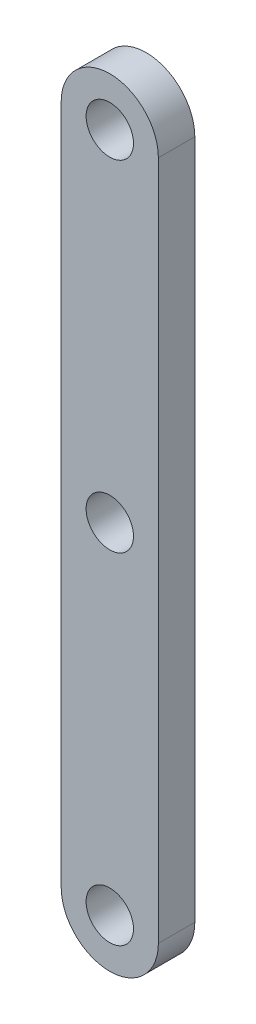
ISO-10303-21;
HEADER;
FILE_DESCRIPTION(('STEP AP214'),'2;1');
FILE_NAME('part.step','',(''),(''),'','','');
FILE_SCHEMA(('AUTOMOTIVE_DESIGN { 1 0 10303 214 1 1 1 1 }'));
ENDSEC;
DATA;
#1=APPLICATION_CONTEXT('core data for automotive mechanical design processes');
#2=APPLICATION_PROTOCOL_DEFINITION('international standard','automotive_design',2000,#1);
#3=PRODUCT_CONTEXT('',#1,'mechanical');
#4=PRODUCT('Part','Part','',(#3));
#5=PRODUCT_RELATED_PRODUCT_CATEGORY('part','',(#4));
#6=PRODUCT_DEFINITION_FORMATION('','',#4);
#7=PRODUCT_DEFINITION_CONTEXT('part definition',#1,'design');
#8=PRODUCT_DEFINITION('design','',#6,#7);
#9=PRODUCT_DEFINITION_SHAPE('','',#8);
#10=(LENGTH_UNIT() NAMED_UNIT(*) SI_UNIT(.MILLI.,.METRE.));
#11=(NAMED_UNIT(*) PLANE_ANGLE_UNIT() SI_UNIT($,.RADIAN.));
#12=(NAMED_UNIT(*) SI_UNIT($,.STERADIAN.) SOLID_ANGLE_UNIT());
#13=UNCERTAINTY_MEASURE_WITH_UNIT(LENGTH_MEASURE(1.E-05),#10,'distance_accuracy_value','');
#14=(GEOMETRIC_REPRESENTATION_CONTEXT(3) GLOBAL_UNCERTAINTY_ASSIGNED_CONTEXT((#13)) GLOBAL_UNIT_ASSIGNED_CONTEXT((#10,
#11,#12)) REPRESENTATION_CONTEXT('',''));
#15=CARTESIAN_POINT('',(0.,0.,0.));
#16=DIRECTION('',(0.,0.,1.));
#17=DIRECTION('',(1.,0.,0.));
#18=AXIS2_PLACEMENT_3D('',#15,#16,#17);
#19=CARTESIAN_POINT('',(0.,0.,3.));
#20=DIRECTION('',(0.,0.,-1.));
#21=DIRECTION('',(-1.,0.,0.));
#22=AXIS2_PLACEMENT_3D('',#19,#20,#21);
#23=CYLINDRICAL_SURFACE('',#22,4.);
#24=CARTESIAN_POINT('',(0.,0.,0.));
#25=DIRECTION('',(0.,0.,1.));
#26=DIRECTION('',(1.,0.,0.));
#27=AXIS2_PLACEMENT_3D('',#24,#25,#26);
#28=CIRCLE('',#27,4.);
#29=CARTESIAN_POINT('',(-4.,0.,0.));
#30=VERTEX_POINT('',#29);
#31=CARTESIAN_POINT('',(4.,0.,0.));
#32=VERTEX_POINT('',#31);
#33=EDGE_CURVE('E98',#30,#32,#28,.T.);
#34=ORIENTED_EDGE('',*,*,#33,.T.);
#35=DIRECTION('',(0.,0.,-1.));
#36=VECTOR('',#35,1.);
#37=CARTESIAN_POINT('',(4.,0.,3.));
#38=LINE('',#37,#36);
#39=CARTESIAN_POINT('',(4.,0.,3.));
#40=VERTEX_POINT('',#39);
#41=EDGE_CURVE('E11',#40,#32,#38,.T.);
#42=ORIENTED_EDGE('',*,*,#41,.F.);
#43=CARTESIAN_POINT('',(0.,0.,3.));
#44=DIRECTION('',(0.,0.,1.));
#45=DIRECTION('',(1.,0.,0.));
#46=AXIS2_PLACEMENT_3D('',#43,#44,#45);
#47=CIRCLE('',#46,4.);
#48=CARTESIAN_POINT('',(-4.,0.,3.));
#49=VERTEX_POINT('',#48);
#50=EDGE_CURVE('E86',#49,#40,#47,.T.);
#51=ORIENTED_EDGE('',*,*,#50,.F.);
#52=DIRECTION('',(0.,0.,-1.));
#53=VECTOR('',#52,1.);
#54=CARTESIAN_POINT('',(-4.,0.,3.));
#55=LINE('',#54,#53);
#56=EDGE_CURVE('E94',#49,#30,#55,.T.);
#57=ORIENTED_EDGE('',*,*,#56,.T.);
#58=EDGE_LOOP('',(#34,#42,#51,#57));
#59=FACE_BOUND('',#58,.T.);
#60=ADVANCED_FACE('F35',(#59),#23,.T.);
#61=CARTESIAN_POINT('',(4.,0.,3.));
#62=DIRECTION('',(-1.,0.,0.));
#63=DIRECTION('',(0.,0.,1.));
#64=AXIS2_PLACEMENT_3D('',#61,#62,#63);
#65=PLANE('',#64);
#66=DIRECTION('',(0.,1.,0.));
#67=VECTOR('',#66,1.);
#68=CARTESIAN_POINT('',(4.,0.,0.));
#69=LINE('',#68,#67);
#70=CARTESIAN_POINT('',(4.,56.,0.));
#71=VERTEX_POINT('',#70);
#72=EDGE_CURVE('E90',#32,#71,#69,.T.);
#73=ORIENTED_EDGE('',*,*,#72,.T.);
#74=DIRECTION('',(0.,0.,-1.));
#75=VECTOR('',#74,1.);
#76=CARTESIAN_POINT('',(4.,56.,3.));
#77=LINE('',#76,#75);
#78=CARTESIAN_POINT('',(4.,56.,3.));
#79=VERTEX_POINT('',#78);
#80=EDGE_CURVE('E43',#79,#71,#77,.T.);
#81=ORIENTED_EDGE('',*,*,#80,.F.);
#82=DIRECTION('',(0.,1.,0.));
#83=VECTOR('',#82,1.);
#84=CARTESIAN_POINT('',(4.,0.,3.));
#85=LINE('',#84,#83);
#86=EDGE_CURVE('E81',#40,#79,#85,.T.);
#87=ORIENTED_EDGE('',*,*,#86,.F.);
#88=ORIENTED_EDGE('',*,*,#41,.T.);
#89=EDGE_LOOP('',(#73,#81,#87,#88));
#90=FACE_BOUND('',#89,.T.);
#91=ADVANCED_FACE('F89',(#90),#65,.F.);
#92=CARTESIAN_POINT('',(0.,56.,3.));
#93=DIRECTION('',(0.,0.,-1.));
#94=DIRECTION('',(-1.,0.,0.));
#95=AXIS2_PLACEMENT_3D('',#92,#93,#94);
#96=CYLINDRICAL_SURFACE('',#95,4.);
#97=CARTESIAN_POINT('',(0.,56.,0.));
#98=DIRECTION('',(0.,0.,1.));
#99=DIRECTION('',(1.,0.,0.));
#100=AXIS2_PLACEMENT_3D('',#97,#98,#99);
#101=CIRCLE('',#100,4.);
#102=CARTESIAN_POINT('',(-4.,56.,0.));
#103=VERTEX_POINT('',#102);
#104=EDGE_CURVE('E68',#71,#103,#101,.T.);
#105=ORIENTED_EDGE('',*,*,#104,.T.);
#106=DIRECTION('',(0.,0.,-1.));
#107=VECTOR('',#106,1.);
#108=CARTESIAN_POINT('',(-4.,56.,3.));
#109=LINE('',#108,#107);
#110=CARTESIAN_POINT('',(-4.,56.,3.));
#111=VERTEX_POINT('',#110);
#112=EDGE_CURVE('E91',#111,#103,#109,.T.);
#113=ORIENTED_EDGE('',*,*,#112,.F.);
#114=CARTESIAN_POINT('',(0.,56.,3.));
#115=DIRECTION('',(0.,0.,1.));
#116=DIRECTION('',(1.,0.,0.));
#117=AXIS2_PLACEMENT_3D('',#114,#115,#116);
#118=CIRCLE('',#117,4.);
#119=EDGE_CURVE('E84',#79,#111,#118,.T.);
#120=ORIENTED_EDGE('',*,*,#119,.F.);
#121=ORIENTED_EDGE('',*,*,#80,.T.);
#122=EDGE_LOOP('',(#105,#113,#120,#121));
#123=FACE_BOUND('',#122,.T.);
#124=ADVANCED_FACE('F92',(#123),#96,.T.);
#125=CARTESIAN_POINT('',(-4.,0.,3.));
#126=DIRECTION('',(1.,0.,0.));
#127=DIRECTION('',(0.,0.,-1.));
#128=AXIS2_PLACEMENT_3D('',#125,#126,#127);
#129=PLANE('',#128);
#130=DIRECTION('',(0.,-1.,0.));
#131=VECTOR('',#130,1.);
#132=CARTESIAN_POINT('',(-4.,0.,0.));
#133=LINE('',#132,#131);
#134=EDGE_CURVE('E74',#103,#30,#133,.T.);
#135=ORIENTED_EDGE('',*,*,#134,.T.);
#136=ORIENTED_EDGE('',*,*,#56,.F.);
#137=DIRECTION('',(0.,-1.,0.));
#138=VECTOR('',#137,1.);
#139=CARTESIAN_POINT('',(-4.,0.,3.));
#140=LINE('',#139,#138);
#141=EDGE_CURVE('E51',#111,#49,#140,.T.);
#142=ORIENTED_EDGE('',*,*,#141,.F.);
#143=ORIENTED_EDGE('',*,*,#112,.T.);
#144=EDGE_LOOP('',(#135,#136,#142,#143));
#145=FACE_BOUND('',#144,.T.);
#146=ADVANCED_FACE('F106',(#145),#129,.F.);
#147=CARTESIAN_POINT('',(0.,0.,3.));
#148=DIRECTION('',(0.,0.,1.));
#149=DIRECTION('',(1.,0.,0.));
#150=AXIS2_PLACEMENT_3D('',#147,#148,#149);
#151=PLANE('',#150);
#152=CARTESIAN_POINT('',(0.,28.,3.));
#153=DIRECTION('',(0.,0.,1.));
#154=DIRECTION('',(1.,0.,0.));
#155=AXIS2_PLACEMENT_3D('',#152,#153,#154);
#156=CIRCLE('',#155,1.95);
#157=CARTESIAN_POINT('',(1.95,28.,3.));
#158=VERTEX_POINT('',#157);
#159=EDGE_CURVE('E126',#158,#158,#156,.T.);
#160=ORIENTED_EDGE('',*,*,#159,.F.);
#161=EDGE_LOOP('',(#160));
#162=FACE_BOUND('',#161,.T.);
#163=CARTESIAN_POINT('',(0.,56.,3.));
#164=DIRECTION('',(0.,0.,1.));
#165=DIRECTION('',(1.,0.,0.));
#166=AXIS2_PLACEMENT_3D('',#163,#164,#165);
#167=CIRCLE('',#166,1.95);
#168=CARTESIAN_POINT('',(1.95,56.,3.));
#169=VERTEX_POINT('',#168);
#170=EDGE_CURVE('E120',#169,#169,#167,.T.);
#171=ORIENTED_EDGE('',*,*,#170,.F.);
#172=EDGE_LOOP('',(#171));
#173=FACE_BOUND('',#172,.T.);
#174=CARTESIAN_POINT('',(0.,0.,3.));
#175=DIRECTION('',(0.,0.,1.));
#176=DIRECTION('',(1.,0.,0.));
#177=AXIS2_PLACEMENT_3D('',#174,#175,#176);
#178=CIRCLE('',#177,1.95);
#179=CARTESIAN_POINT('',(1.95,0.,3.));
#180=VERTEX_POINT('',#179);
#181=EDGE_CURVE('E114',#180,#180,#178,.T.);
#182=ORIENTED_EDGE('',*,*,#181,.F.);
#183=EDGE_LOOP('',(#182));
#184=FACE_BOUND('',#183,.T.);
#185=ORIENTED_EDGE('',*,*,#50,.T.);
#186=ORIENTED_EDGE('',*,*,#86,.T.);
#187=ORIENTED_EDGE('',*,*,#119,.T.);
#188=ORIENTED_EDGE('',*,*,#141,.T.);
#189=EDGE_LOOP('',(#185,#186,#187,#188));
#190=FACE_BOUND('',#189,.T.);
#191=ADVANCED_FACE('F82',(#162,#173,#184,#190),#151,.T.);
#192=CARTESIAN_POINT('',(0.,0.,0.));
#193=DIRECTION('',(0.,0.,1.));
#194=DIRECTION('',(1.,0.,0.));
#195=AXIS2_PLACEMENT_3D('',#192,#193,#194);
#196=PLANE('',#195);
#197=CARTESIAN_POINT('',(0.,28.,0.));
#198=DIRECTION('',(0.,0.,1.));
#199=DIRECTION('',(1.,0.,0.));
#200=AXIS2_PLACEMENT_3D('',#197,#198,#199);
#201=CIRCLE('',#200,1.95);
#202=CARTESIAN_POINT('',(1.95,28.,0.));
#203=VERTEX_POINT('',#202);
#204=EDGE_CURVE('E123',#203,#203,#201,.T.);
#205=ORIENTED_EDGE('',*,*,#204,.T.);
#206=EDGE_LOOP('',(#205));
#207=FACE_BOUND('',#206,.T.);
#208=CARTESIAN_POINT('',(0.,56.,0.));
#209=DIRECTION('',(0.,0.,1.));
#210=DIRECTION('',(1.,0.,0.));
#211=AXIS2_PLACEMENT_3D('',#208,#209,#210);
#212=CIRCLE('',#211,1.95);
#213=CARTESIAN_POINT('',(1.95,56.,0.));
#214=VERTEX_POINT('',#213);
#215=EDGE_CURVE('E117',#214,#214,#212,.T.);
#216=ORIENTED_EDGE('',*,*,#215,.T.);
#217=EDGE_LOOP('',(#216));
#218=FACE_BOUND('',#217,.T.);
#219=CARTESIAN_POINT('',(0.,0.,0.));
#220=DIRECTION('',(0.,0.,1.));
#221=DIRECTION('',(1.,0.,0.));
#222=AXIS2_PLACEMENT_3D('',#219,#220,#221);
#223=CIRCLE('',#222,1.95);
#224=CARTESIAN_POINT('',(1.95,0.,0.));
#225=VERTEX_POINT('',#224);
#226=EDGE_CURVE('E101',#225,#225,#223,.T.);
#227=ORIENTED_EDGE('',*,*,#226,.T.);
#228=EDGE_LOOP('',(#227));
#229=FACE_BOUND('',#228,.T.);
#230=ORIENTED_EDGE('',*,*,#33,.F.);
#231=ORIENTED_EDGE('',*,*,#134,.F.);
#232=ORIENTED_EDGE('',*,*,#104,.F.);
#233=ORIENTED_EDGE('',*,*,#72,.F.);
#234=EDGE_LOOP('',(#230,#231,#232,#233));
#235=FACE_BOUND('',#234,.T.);
#236=ADVANCED_FACE('F109',(#207,#218,#229,#235),#196,.F.);
#237=CARTESIAN_POINT('',(0.,0.,3.));
#238=DIRECTION('',(0.,0.,1.));
#239=DIRECTION('',(1.,0.,0.));
#240=AXIS2_PLACEMENT_3D('',#237,#238,#239);
#241=CYLINDRICAL_SURFACE('',#240,1.95);
#242=ORIENTED_EDGE('',*,*,#226,.F.);
#243=EDGE_LOOP('',(#242));
#244=FACE_BOUND('',#243,.T.);
#245=ORIENTED_EDGE('',*,*,#181,.T.);
#246=EDGE_LOOP('',(#245));
#247=FACE_BOUND('',#246,.T.);
#248=ADVANCED_FACE('F139',(#244,#247),#241,.F.);
#249=CARTESIAN_POINT('',(0.,56.,3.));
#250=DIRECTION('',(0.,0.,1.));
#251=DIRECTION('',(1.,0.,0.));
#252=AXIS2_PLACEMENT_3D('',#249,#250,#251);
#253=CYLINDRICAL_SURFACE('',#252,1.95);
#254=ORIENTED_EDGE('',*,*,#215,.F.);
#255=EDGE_LOOP('',(#254));
#256=FACE_BOUND('',#255,.T.);
#257=ORIENTED_EDGE('',*,*,#170,.T.);
#258=EDGE_LOOP('',(#257));
#259=FACE_BOUND('',#258,.T.);
#260=ADVANCED_FACE('F141',(#256,#259),#253,.F.);
#261=CARTESIAN_POINT('',(0.,28.,3.));
#262=DIRECTION('',(0.,0.,1.));
#263=DIRECTION('',(1.,0.,0.));
#264=AXIS2_PLACEMENT_3D('',#261,#262,#263);
#265=CYLINDRICAL_SURFACE('',#264,1.95);
#266=ORIENTED_EDGE('',*,*,#204,.F.);
#267=EDGE_LOOP('',(#266));
#268=FACE_BOUND('',#267,.T.);
#269=ORIENTED_EDGE('',*,*,#159,.T.);
#270=EDGE_LOOP('',(#269));
#271=FACE_BOUND('',#270,.T.);
#272=ADVANCED_FACE('F130',(#268,#271),#265,.F.);
#273=CLOSED_SHELL('',(#60,#91,#124,#146,#191,#236,#248,#260,#272));
#274=MANIFOLD_SOLID_BREP('B2',#273);
#275=ADVANCED_BREP_SHAPE_REPRESENTATION('',(#18,#274),#14);
#276=SHAPE_DEFINITION_REPRESENTATION(#9,#275);
ENDSEC;
END-ISO-10303-21;
